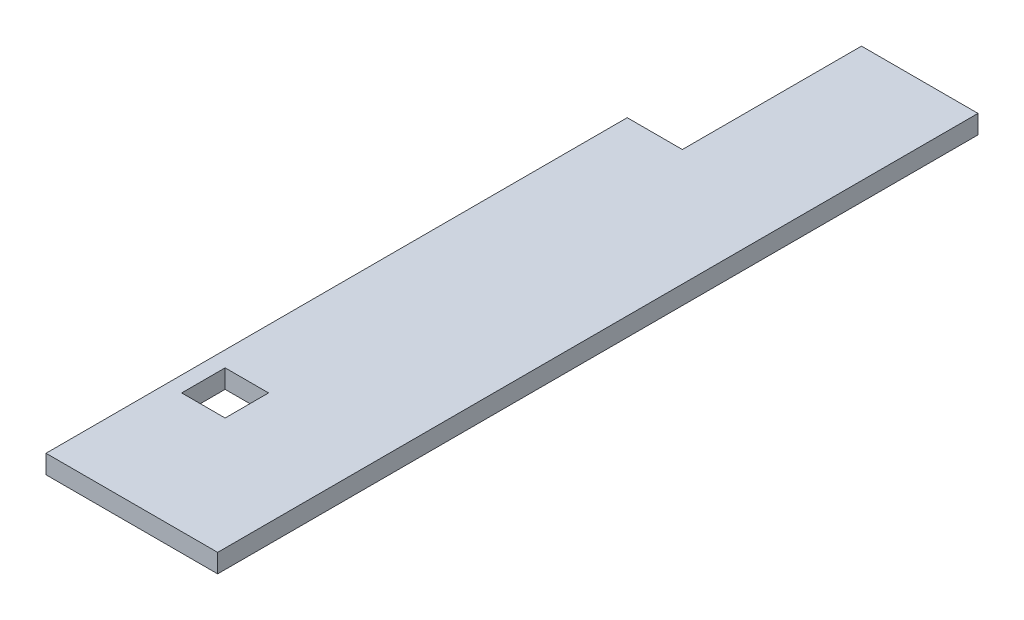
ISO-10303-21;
HEADER;
FILE_DESCRIPTION(('STEP AP214'),'2;1');
FILE_NAME('part.step','',(''),(''),'','','');
FILE_SCHEMA(('AUTOMOTIVE_DESIGN { 1 0 10303 214 1 1 1 1 }'));
ENDSEC;
DATA;
#1=APPLICATION_CONTEXT('core data for automotive mechanical design processes');
#2=APPLICATION_PROTOCOL_DEFINITION('international standard','automotive_design',2000,#1);
#3=PRODUCT_CONTEXT('',#1,'mechanical');
#4=PRODUCT('Part','Part','',(#3));
#5=PRODUCT_RELATED_PRODUCT_CATEGORY('part','',(#4));
#6=PRODUCT_DEFINITION_FORMATION('','',#4);
#7=PRODUCT_DEFINITION_CONTEXT('part definition',#1,'design');
#8=PRODUCT_DEFINITION('design','',#6,#7);
#9=PRODUCT_DEFINITION_SHAPE('','',#8);
#10=(LENGTH_UNIT() NAMED_UNIT(*) SI_UNIT(.MILLI.,.METRE.));
#11=(NAMED_UNIT(*) PLANE_ANGLE_UNIT() SI_UNIT($,.RADIAN.));
#12=(NAMED_UNIT(*) SI_UNIT($,.STERADIAN.) SOLID_ANGLE_UNIT());
#13=UNCERTAINTY_MEASURE_WITH_UNIT(LENGTH_MEASURE(1.E-05),#10,'distance_accuracy_value','');
#14=(GEOMETRIC_REPRESENTATION_CONTEXT(3) GLOBAL_UNCERTAINTY_ASSIGNED_CONTEXT((#13)) GLOBAL_UNIT_ASSIGNED_CONTEXT((#10,
#11,#12)) REPRESENTATION_CONTEXT('',''));
#15=CARTESIAN_POINT('',(0.,0.,0.));
#16=DIRECTION('',(0.,0.,1.));
#17=DIRECTION('',(1.,0.,0.));
#18=AXIS2_PLACEMENT_3D('',#15,#16,#17);
#19=CARTESIAN_POINT('',(584.2,127.,-1978.07072));
#20=DIRECTION('',(-1.,0.,0.));
#21=DIRECTION('',(0.,0.,1.));
#22=AXIS2_PLACEMENT_3D('',#19,#20,#21);
#23=PLANE('',#22);
#24=DIRECTION('',(0.,0.,-1.));
#25=VECTOR('',#24,1.);
#26=CARTESIAN_POINT('',(584.2,0.,-1978.07072));
#27=LINE('',#26,#25);
#28=CARTESIAN_POINT('',(584.2,0.,1978.07072));
#29=VERTEX_POINT('',#28);
#30=CARTESIAN_POINT('',(584.2,0.,-3197.27072));
#31=VERTEX_POINT('',#30);
#32=EDGE_CURVE('E196',#29,#31,#27,.T.);
#33=ORIENTED_EDGE('',*,*,#32,.T.);
#34=DIRECTION('',(0.,-1.,0.));
#35=VECTOR('',#34,1.);
#36=CARTESIAN_POINT('',(584.2,127.,-3197.27072));
#37=LINE('',#36,#35);
#38=CARTESIAN_POINT('',(584.2,127.,-3197.27072));
#39=VERTEX_POINT('',#38);
#40=EDGE_CURVE('E200',#39,#31,#37,.T.);
#41=ORIENTED_EDGE('',*,*,#40,.F.);
#42=DIRECTION('',(0.,0.,-1.));
#43=VECTOR('',#42,1.);
#44=CARTESIAN_POINT('',(584.2,127.,-1978.07072));
#45=LINE('',#44,#43);
#46=CARTESIAN_POINT('',(584.2,127.,1978.07072));
#47=VERTEX_POINT('',#46);
#48=EDGE_CURVE('E213',#47,#39,#45,.T.);
#49=ORIENTED_EDGE('',*,*,#48,.F.);
#50=DIRECTION('',(0.,-1.,0.));
#51=VECTOR('',#50,1.);
#52=CARTESIAN_POINT('',(584.2,127.,1978.07072));
#53=LINE('',#52,#51);
#54=EDGE_CURVE('E202',#47,#29,#53,.T.);
#55=ORIENTED_EDGE('',*,*,#54,.T.);
#56=EDGE_LOOP('',(#33,#41,#49,#55));
#57=FACE_BOUND('',#56,.T.);
#58=ADVANCED_FACE('F34',(#57),#23,.F.);
#59=CARTESIAN_POINT('',(-584.2,127.,-1978.07072));
#60=DIRECTION('',(0.,0.,1.));
#61=DIRECTION('',(1.,0.,0.));
#62=AXIS2_PLACEMENT_3D('',#59,#60,#61);
#63=PLANE('',#62);
#64=DIRECTION('',(-1.,0.,0.));
#65=VECTOR('',#64,1.);
#66=CARTESIAN_POINT('',(-584.2,127.,-1978.07072));
#67=LINE('',#66,#65);
#68=CARTESIAN_POINT('',(-208.8642,127.,-1978.07072));
#69=VERTEX_POINT('',#68);
#70=CARTESIAN_POINT('',(-584.2,127.,-1978.07072));
#71=VERTEX_POINT('',#70);
#72=EDGE_CURVE('E153',#69,#71,#67,.T.);
#73=ORIENTED_EDGE('',*,*,#72,.F.);
#74=DIRECTION('',(0.,-1.,0.));
#75=VECTOR('',#74,1.);
#76=CARTESIAN_POINT('',(-208.8642,127.,-1978.07072));
#77=LINE('',#76,#75);
#78=CARTESIAN_POINT('',(-208.8642,0.,-1978.07072));
#79=VERTEX_POINT('',#78);
#80=EDGE_CURVE('E149',#69,#79,#77,.T.);
#81=ORIENTED_EDGE('',*,*,#80,.T.);
#82=DIRECTION('',(-1.,0.,0.));
#83=VECTOR('',#82,1.);
#84=CARTESIAN_POINT('',(-584.2,0.,-1978.07072));
#85=LINE('',#84,#83);
#86=CARTESIAN_POINT('',(-584.2,0.,-1978.07072));
#87=VERTEX_POINT('',#86);
#88=EDGE_CURVE('E204',#79,#87,#85,.T.);
#89=ORIENTED_EDGE('',*,*,#88,.T.);
#90=DIRECTION('',(0.,-1.,0.));
#91=VECTOR('',#90,1.);
#92=CARTESIAN_POINT('',(-584.2,127.,-1978.07072));
#93=LINE('',#92,#91);
#94=EDGE_CURVE('E164',#71,#87,#93,.T.);
#95=ORIENTED_EDGE('',*,*,#94,.F.);
#96=EDGE_LOOP('',(#73,#81,#89,#95));
#97=FACE_BOUND('',#96,.T.);
#98=ADVANCED_FACE('F186',(#97),#63,.F.);
#99=CARTESIAN_POINT('',(-584.2,127.,-1978.07072));
#100=DIRECTION('',(1.,0.,0.));
#101=DIRECTION('',(0.,0.,-1.));
#102=AXIS2_PLACEMENT_3D('',#99,#100,#101);
#103=PLANE('',#102);
#104=DIRECTION('',(0.,0.,1.));
#105=VECTOR('',#104,1.);
#106=CARTESIAN_POINT('',(-584.2,0.,-1978.07072));
#107=LINE('',#106,#105);
#108=CARTESIAN_POINT('',(-584.2,0.,1978.07072));
#109=VERTEX_POINT('',#108);
#110=EDGE_CURVE('E223',#87,#109,#107,.T.);
#111=ORIENTED_EDGE('',*,*,#110,.T.);
#112=DIRECTION('',(0.,-1.,0.));
#113=VECTOR('',#112,1.);
#114=CARTESIAN_POINT('',(-584.2,127.,1978.07072));
#115=LINE('',#114,#113);
#116=CARTESIAN_POINT('',(-584.2,127.,1978.07072));
#117=VERTEX_POINT('',#116);
#118=EDGE_CURVE('E228',#117,#109,#115,.T.);
#119=ORIENTED_EDGE('',*,*,#118,.F.);
#120=DIRECTION('',(0.,0.,1.));
#121=VECTOR('',#120,1.);
#122=CARTESIAN_POINT('',(-584.2,127.,-1978.07072));
#123=LINE('',#122,#121);
#124=EDGE_CURVE('E217',#71,#117,#123,.T.);
#125=ORIENTED_EDGE('',*,*,#124,.F.);
#126=ORIENTED_EDGE('',*,*,#94,.T.);
#127=EDGE_LOOP('',(#111,#119,#125,#126));
#128=FACE_BOUND('',#127,.T.);
#129=ADVANCED_FACE('F191',(#128),#103,.F.);
#130=CARTESIAN_POINT('',(-584.2,127.,1978.07072));
#131=DIRECTION('',(0.,0.,-1.));
#132=DIRECTION('',(-1.,0.,0.));
#133=AXIS2_PLACEMENT_3D('',#130,#131,#132);
#134=PLANE('',#133);
#135=DIRECTION('',(1.,0.,0.));
#136=VECTOR('',#135,1.);
#137=CARTESIAN_POINT('',(-584.2,0.,1978.07072));
#138=LINE('',#137,#136);
#139=EDGE_CURVE('E214',#109,#29,#138,.T.);
#140=ORIENTED_EDGE('',*,*,#139,.T.);
#141=ORIENTED_EDGE('',*,*,#54,.F.);
#142=DIRECTION('',(1.,0.,0.));
#143=VECTOR('',#142,1.);
#144=CARTESIAN_POINT('',(-584.2,127.,1978.07072));
#145=LINE('',#144,#143);
#146=EDGE_CURVE('E219',#117,#47,#145,.T.);
#147=ORIENTED_EDGE('',*,*,#146,.F.);
#148=ORIENTED_EDGE('',*,*,#118,.T.);
#149=EDGE_LOOP('',(#140,#141,#147,#148));
#150=FACE_BOUND('',#149,.T.);
#151=ADVANCED_FACE('F238',(#150),#134,.F.);
#152=CARTESIAN_POINT('',(584.2,127.,1978.07072));
#153=DIRECTION('',(0.,1.,0.));
#154=DIRECTION('',(0.,0.,1.));
#155=AXIS2_PLACEMENT_3D('',#152,#153,#154);
#156=PLANE('',#155);
#157=DIRECTION('',(0.,0.,1.));
#158=VECTOR('',#157,1.);
#159=CARTESIAN_POINT('',(-478.0788,127.,1160.74952));
#160=LINE('',#159,#158);
#161=CARTESIAN_POINT('',(-478.0788,127.,864.99192));
#162=VERTEX_POINT('',#161);
#163=CARTESIAN_POINT('',(-478.0788,127.,1160.74952));
#164=VERTEX_POINT('',#163);
#165=EDGE_CURVE('E48',#162,#164,#160,.T.);
#166=ORIENTED_EDGE('',*,*,#165,.F.);
#167=DIRECTION('',(-1.,0.,0.));
#168=VECTOR('',#167,1.);
#169=CARTESIAN_POINT('',(-478.0788,127.,864.99192));
#170=LINE('',#169,#168);
#171=CARTESIAN_POINT('',(-182.3212,127.,864.99192));
#172=VERTEX_POINT('',#171);
#173=EDGE_CURVE('E129',#172,#162,#170,.T.);
#174=ORIENTED_EDGE('',*,*,#173,.F.);
#175=DIRECTION('',(0.,0.,-1.));
#176=VECTOR('',#175,1.);
#177=CARTESIAN_POINT('',(-182.3212,127.,1160.74952));
#178=LINE('',#177,#176);
#179=CARTESIAN_POINT('',(-182.3212,127.,1160.74952));
#180=VERTEX_POINT('',#179);
#181=EDGE_CURVE('E113',#180,#172,#178,.T.);
#182=ORIENTED_EDGE('',*,*,#181,.F.);
#183=DIRECTION('',(1.,0.,0.));
#184=VECTOR('',#183,1.);
#185=CARTESIAN_POINT('',(-478.0788,127.,1160.74952));
#186=LINE('',#185,#184);
#187=EDGE_CURVE('E122',#164,#180,#186,.T.);
#188=ORIENTED_EDGE('',*,*,#187,.F.);
#189=EDGE_LOOP('',(#166,#174,#182,#188));
#190=FACE_BOUND('',#189,.T.);
#191=ORIENTED_EDGE('',*,*,#48,.T.);
#192=DIRECTION('',(-1.,0.,0.));
#193=VECTOR('',#192,1.);
#194=CARTESIAN_POINT('',(584.2,127.,-3197.27072));
#195=LINE('',#194,#193);
#196=CARTESIAN_POINT('',(-208.8642,127.,-3197.27072));
#197=VERTEX_POINT('',#196);
#198=EDGE_CURVE('E139',#39,#197,#195,.T.);
#199=ORIENTED_EDGE('',*,*,#198,.T.);
#200=DIRECTION('',(0.,0.,1.));
#201=VECTOR('',#200,1.);
#202=CARTESIAN_POINT('',(-208.8642,127.,-1978.07072));
#203=LINE('',#202,#201);
#204=EDGE_CURVE('E141',#197,#69,#203,.T.);
#205=ORIENTED_EDGE('',*,*,#204,.T.);
#206=ORIENTED_EDGE('',*,*,#72,.T.);
#207=ORIENTED_EDGE('',*,*,#124,.T.);
#208=ORIENTED_EDGE('',*,*,#146,.T.);
#209=EDGE_LOOP('',(#191,#199,#205,#206,#207,#208));
#210=FACE_BOUND('',#209,.T.);
#211=ADVANCED_FACE('F126',(#190,#210),#156,.T.);
#212=CARTESIAN_POINT('',(584.2,0.,1978.07072));
#213=DIRECTION('',(0.,1.,0.));
#214=DIRECTION('',(0.,0.,1.));
#215=AXIS2_PLACEMENT_3D('',#212,#213,#214);
#216=PLANE('',#215);
#217=DIRECTION('',(-1.,0.,0.));
#218=VECTOR('',#217,1.);
#219=CARTESIAN_POINT('',(584.2,0.,864.99192));
#220=LINE('',#219,#218);
#221=CARTESIAN_POINT('',(-182.3212,0.,864.99192));
#222=VERTEX_POINT('',#221);
#223=CARTESIAN_POINT('',(-478.0788,0.,864.99192));
#224=VERTEX_POINT('',#223);
#225=EDGE_CURVE('E41',#222,#224,#220,.T.);
#226=ORIENTED_EDGE('',*,*,#225,.T.);
#227=DIRECTION('',(0.,0.,1.));
#228=VECTOR('',#227,1.);
#229=CARTESIAN_POINT('',(-478.0788,0.,1978.07072));
#230=LINE('',#229,#228);
#231=CARTESIAN_POINT('',(-478.0788,0.,1160.74952));
#232=VERTEX_POINT('',#231);
#233=EDGE_CURVE('E11',#224,#232,#230,.T.);
#234=ORIENTED_EDGE('',*,*,#233,.T.);
#235=DIRECTION('',(1.,0.,0.));
#236=VECTOR('',#235,1.);
#237=CARTESIAN_POINT('',(584.2,0.,1160.74952));
#238=LINE('',#237,#236);
#239=CARTESIAN_POINT('',(-182.3212,0.,1160.74952));
#240=VERTEX_POINT('',#239);
#241=EDGE_CURVE('E162',#232,#240,#238,.T.);
#242=ORIENTED_EDGE('',*,*,#241,.T.);
#243=DIRECTION('',(0.,0.,-1.));
#244=VECTOR('',#243,1.);
#245=CARTESIAN_POINT('',(-182.3212,0.,1978.07072));
#246=LINE('',#245,#244);
#247=EDGE_CURVE('E116',#240,#222,#246,.T.);
#248=ORIENTED_EDGE('',*,*,#247,.T.);
#249=EDGE_LOOP('',(#226,#234,#242,#248));
#250=FACE_BOUND('',#249,.T.);
#251=ORIENTED_EDGE('',*,*,#32,.F.);
#252=ORIENTED_EDGE('',*,*,#139,.F.);
#253=ORIENTED_EDGE('',*,*,#110,.F.);
#254=ORIENTED_EDGE('',*,*,#88,.F.);
#255=DIRECTION('',(0.,0.,1.));
#256=VECTOR('',#255,1.);
#257=CARTESIAN_POINT('',(-208.8642,0.,-1978.07072));
#258=LINE('',#257,#256);
#259=CARTESIAN_POINT('',(-208.8642,0.,-3197.27072));
#260=VERTEX_POINT('',#259);
#261=EDGE_CURVE('E142',#260,#79,#258,.T.);
#262=ORIENTED_EDGE('',*,*,#261,.F.);
#263=DIRECTION('',(-1.,0.,0.));
#264=VECTOR('',#263,1.);
#265=CARTESIAN_POINT('',(584.2,0.,-3197.27072));
#266=LINE('',#265,#264);
#267=EDGE_CURVE('E136',#31,#260,#266,.T.);
#268=ORIENTED_EDGE('',*,*,#267,.F.);
#269=EDGE_LOOP('',(#251,#252,#253,#254,#262,#268));
#270=FACE_BOUND('',#269,.T.);
#271=ADVANCED_FACE('F167',(#250,#270),#216,.F.);
#272=CARTESIAN_POINT('',(584.2,127.,-3197.27072));
#273=DIRECTION('',(0.,0.,1.));
#274=DIRECTION('',(1.,0.,0.));
#275=AXIS2_PLACEMENT_3D('',#272,#273,#274);
#276=PLANE('',#275);
#277=ORIENTED_EDGE('',*,*,#267,.T.);
#278=DIRECTION('',(0.,-1.,0.));
#279=VECTOR('',#278,1.);
#280=CARTESIAN_POINT('',(-208.8642,127.,-3197.27072));
#281=LINE('',#280,#279);
#282=EDGE_CURVE('E146',#197,#260,#281,.T.);
#283=ORIENTED_EDGE('',*,*,#282,.F.);
#284=ORIENTED_EDGE('',*,*,#198,.F.);
#285=ORIENTED_EDGE('',*,*,#40,.T.);
#286=EDGE_LOOP('',(#277,#283,#284,#285));
#287=FACE_BOUND('',#286,.T.);
#288=ADVANCED_FACE('F181',(#287),#276,.F.);
#289=CARTESIAN_POINT('',(-208.8642,127.,-1978.07072));
#290=DIRECTION('',(1.,0.,0.));
#291=DIRECTION('',(0.,0.,-1.));
#292=AXIS2_PLACEMENT_3D('',#289,#290,#291);
#293=PLANE('',#292);
#294=ORIENTED_EDGE('',*,*,#261,.T.);
#295=ORIENTED_EDGE('',*,*,#80,.F.);
#296=ORIENTED_EDGE('',*,*,#204,.F.);
#297=ORIENTED_EDGE('',*,*,#282,.T.);
#298=EDGE_LOOP('',(#294,#295,#296,#297));
#299=FACE_BOUND('',#298,.T.);
#300=ADVANCED_FACE('F174',(#299),#293,.F.);
#301=CARTESIAN_POINT('',(-478.0788,-5.00000000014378E-05,1160.74952));
#302=DIRECTION('',(-1.,0.,0.));
#303=DIRECTION('',(0.,0.,1.));
#304=AXIS2_PLACEMENT_3D('',#301,#302,#303);
#305=PLANE('',#304);
#306=DIRECTION('',(0.,1.,0.));
#307=VECTOR('',#306,1.);
#308=CARTESIAN_POINT('',(-478.0788,-5.00000000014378E-05,864.99192));
#309=LINE('',#308,#307);
#310=EDGE_CURVE('E134',#224,#162,#309,.T.);
#311=ORIENTED_EDGE('',*,*,#310,.T.);
#312=ORIENTED_EDGE('',*,*,#165,.T.);
#313=DIRECTION('',(0.,1.,0.));
#314=VECTOR('',#313,1.);
#315=CARTESIAN_POINT('',(-478.0788,-5.00000000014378E-05,1160.74952));
#316=LINE('',#315,#314);
#317=EDGE_CURVE('E119',#232,#164,#316,.T.);
#318=ORIENTED_EDGE('',*,*,#317,.F.);
#319=ORIENTED_EDGE('',*,*,#233,.F.);
#320=EDGE_LOOP('',(#311,#312,#318,#319));
#321=FACE_BOUND('',#320,.T.);
#322=ADVANCED_FACE('F172',(#321),#305,.F.);
#323=CARTESIAN_POINT('',(-478.0788,-5.00000000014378E-05,864.99192));
#324=DIRECTION('',(0.,0.,-1.));
#325=DIRECTION('',(-1.,0.,0.));
#326=AXIS2_PLACEMENT_3D('',#323,#324,#325);
#327=PLANE('',#326);
#328=DIRECTION('',(0.,1.,0.));
#329=VECTOR('',#328,1.);
#330=CARTESIAN_POINT('',(-182.3212,-5.00000000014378E-05,864.99192));
#331=LINE('',#330,#329);
#332=EDGE_CURVE('E118',#222,#172,#331,.T.);
#333=ORIENTED_EDGE('',*,*,#332,.T.);
#334=ORIENTED_EDGE('',*,*,#173,.T.);
#335=ORIENTED_EDGE('',*,*,#310,.F.);
#336=ORIENTED_EDGE('',*,*,#225,.F.);
#337=EDGE_LOOP('',(#333,#334,#335,#336));
#338=FACE_BOUND('',#337,.T.);
#339=ADVANCED_FACE('F171',(#338),#327,.F.);
#340=CARTESIAN_POINT('',(-182.3212,-5.00000000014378E-05,1160.74952));
#341=DIRECTION('',(1.,0.,0.));
#342=DIRECTION('',(0.,0.,-1.));
#343=AXIS2_PLACEMENT_3D('',#340,#341,#342);
#344=PLANE('',#343);
#345=DIRECTION('',(0.,1.,0.));
#346=VECTOR('',#345,1.);
#347=CARTESIAN_POINT('',(-182.3212,-5.00000000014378E-05,1160.74952));
#348=LINE('',#347,#346);
#349=EDGE_CURVE('E56',#240,#180,#348,.T.);
#350=ORIENTED_EDGE('',*,*,#349,.T.);
#351=ORIENTED_EDGE('',*,*,#181,.T.);
#352=ORIENTED_EDGE('',*,*,#332,.F.);
#353=ORIENTED_EDGE('',*,*,#247,.F.);
#354=EDGE_LOOP('',(#350,#351,#352,#353));
#355=FACE_BOUND('',#354,.T.);
#356=ADVANCED_FACE('F110',(#355),#344,.F.);
#357=CARTESIAN_POINT('',(-478.0788,-5.00000000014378E-05,1160.74952));
#358=DIRECTION('',(0.,0.,1.));
#359=DIRECTION('',(1.,0.,0.));
#360=AXIS2_PLACEMENT_3D('',#357,#358,#359);
#361=PLANE('',#360);
#362=ORIENTED_EDGE('',*,*,#317,.T.);
#363=ORIENTED_EDGE('',*,*,#187,.T.);
#364=ORIENTED_EDGE('',*,*,#349,.F.);
#365=ORIENTED_EDGE('',*,*,#241,.F.);
#366=EDGE_LOOP('',(#362,#363,#364,#365));
#367=FACE_BOUND('',#366,.T.);
#368=ADVANCED_FACE('F123',(#367),#361,.F.);
#369=CLOSED_SHELL('',(#58,#98,#129,#151,#211,#271,#288,#300,#322,#339,#356,#368));
#370=MANIFOLD_SOLID_BREP('B2',#369);
#371=ADVANCED_BREP_SHAPE_REPRESENTATION('',(#18,#370),#14);
#372=SHAPE_DEFINITION_REPRESENTATION(#9,#371);
ENDSEC;
END-ISO-10303-21;
